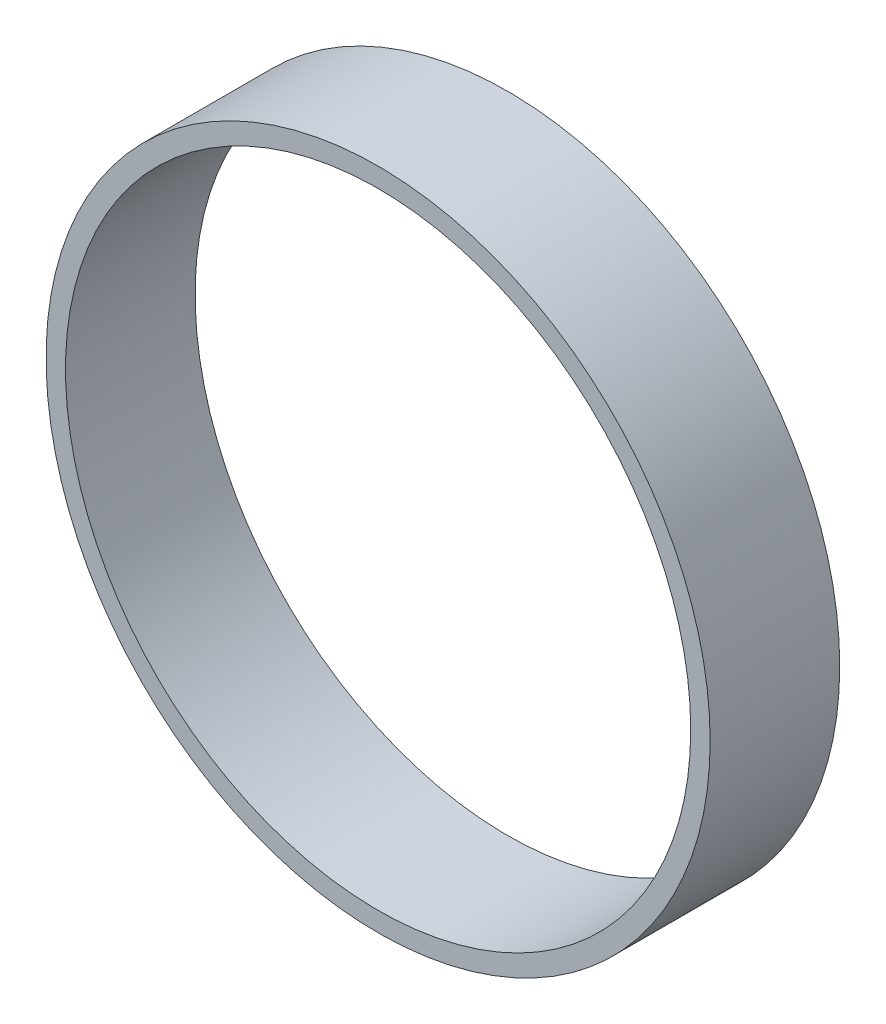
ISO-10303-21;
HEADER;
FILE_DESCRIPTION(('STEP AP214'),'2;1');
FILE_NAME('part.step','',(''),(''),'','','');
FILE_SCHEMA(('AUTOMOTIVE_DESIGN { 1 0 10303 214 1 1 1 1 }'));
ENDSEC;
DATA;
#1=APPLICATION_CONTEXT('core data for automotive mechanical design processes');
#2=APPLICATION_PROTOCOL_DEFINITION('international standard','automotive_design',2000,#1);
#3=PRODUCT_CONTEXT('',#1,'mechanical');
#4=PRODUCT('Part','Part','',(#3));
#5=PRODUCT_RELATED_PRODUCT_CATEGORY('part','',(#4));
#6=PRODUCT_DEFINITION_FORMATION('','',#4);
#7=PRODUCT_DEFINITION_CONTEXT('part definition',#1,'design');
#8=PRODUCT_DEFINITION('design','',#6,#7);
#9=PRODUCT_DEFINITION_SHAPE('','',#8);
#10=(LENGTH_UNIT() NAMED_UNIT(*) SI_UNIT(.MILLI.,.METRE.));
#11=(NAMED_UNIT(*) PLANE_ANGLE_UNIT() SI_UNIT($,.RADIAN.));
#12=(NAMED_UNIT(*) SI_UNIT($,.STERADIAN.) SOLID_ANGLE_UNIT());
#13=UNCERTAINTY_MEASURE_WITH_UNIT(LENGTH_MEASURE(1.E-05),#10,'distance_accuracy_value','');
#14=(GEOMETRIC_REPRESENTATION_CONTEXT(3) GLOBAL_UNCERTAINTY_ASSIGNED_CONTEXT((#13)) GLOBAL_UNIT_ASSIGNED_CONTEXT((#10,
#11,#12)) REPRESENTATION_CONTEXT('',''));
#15=CARTESIAN_POINT('',(0.,0.,0.));
#16=DIRECTION('',(0.,0.,1.));
#17=DIRECTION('',(1.,0.,0.));
#18=AXIS2_PLACEMENT_3D('',#15,#16,#17);
#19=CARTESIAN_POINT('',(0.,0.,-10.16));
#20=DIRECTION('',(0.,0.,1.));
#21=DIRECTION('',(1.,0.,0.));
#22=AXIS2_PLACEMENT_3D('',#19,#20,#21);
#23=CYLINDRICAL_SURFACE('',#22,26.035);
#24=CARTESIAN_POINT('',(0.,0.,-10.16));
#25=DIRECTION('',(0.,0.,1.));
#26=DIRECTION('',(1.,0.,0.));
#27=AXIS2_PLACEMENT_3D('',#24,#25,#26);
#28=CIRCLE('',#27,26.035);
#29=CARTESIAN_POINT('',(26.035,0.,-10.16));
#30=VERTEX_POINT('',#29);
#31=EDGE_CURVE('E10',#30,#30,#28,.T.);
#32=ORIENTED_EDGE('',*,*,#31,.T.);
#33=EDGE_LOOP('',(#32));
#34=FACE_BOUND('',#33,.T.);
#35=CARTESIAN_POINT('',(0.,0.,0.));
#36=DIRECTION('',(0.,0.,1.));
#37=DIRECTION('',(1.,0.,0.));
#38=AXIS2_PLACEMENT_3D('',#35,#36,#37);
#39=CIRCLE('',#38,26.035);
#40=CARTESIAN_POINT('',(26.035,0.,0.));
#41=VERTEX_POINT('',#40);
#42=EDGE_CURVE('E34',#41,#41,#39,.T.);
#43=ORIENTED_EDGE('',*,*,#42,.F.);
#44=EDGE_LOOP('',(#43));
#45=FACE_BOUND('',#44,.T.);
#46=ADVANCED_FACE('F31',(#34,#45),#23,.T.);
#47=CARTESIAN_POINT('',(0.,0.,-10.16));
#48=DIRECTION('',(0.,0.,1.));
#49=DIRECTION('',(1.,0.,0.));
#50=AXIS2_PLACEMENT_3D('',#47,#48,#49);
#51=PLANE('',#50);
#52=CARTESIAN_POINT('',(0.,0.,-10.16));
#53=DIRECTION('',(0.,0.,1.));
#54=DIRECTION('',(1.,0.,0.));
#55=AXIS2_PLACEMENT_3D('',#52,#53,#54);
#56=CIRCLE('',#55,24.511);
#57=CARTESIAN_POINT('',(24.511,0.,-10.16));
#58=VERTEX_POINT('',#57);
#59=EDGE_CURVE('E41',#58,#58,#56,.T.);
#60=ORIENTED_EDGE('',*,*,#59,.T.);
#61=EDGE_LOOP('',(#60));
#62=FACE_BOUND('',#61,.T.);
#63=ORIENTED_EDGE('',*,*,#31,.F.);
#64=EDGE_LOOP('',(#63));
#65=FACE_BOUND('',#64,.T.);
#66=ADVANCED_FACE('F49',(#62,#65),#51,.F.);
#67=CARTESIAN_POINT('',(0.,0.,0.));
#68=DIRECTION('',(0.,0.,1.));
#69=DIRECTION('',(1.,0.,0.));
#70=AXIS2_PLACEMENT_3D('',#67,#68,#69);
#71=PLANE('',#70);
#72=CARTESIAN_POINT('',(0.,0.,0.));
#73=DIRECTION('',(0.,0.,1.));
#74=DIRECTION('',(1.,0.,0.));
#75=AXIS2_PLACEMENT_3D('',#72,#73,#74);
#76=CIRCLE('',#75,24.511);
#77=CARTESIAN_POINT('',(24.511,0.,0.));
#78=VERTEX_POINT('',#77);
#79=EDGE_CURVE('E43',#78,#78,#76,.T.);
#80=ORIENTED_EDGE('',*,*,#79,.F.);
#81=EDGE_LOOP('',(#80));
#82=FACE_BOUND('',#81,.T.);
#83=ORIENTED_EDGE('',*,*,#42,.T.);
#84=EDGE_LOOP('',(#83));
#85=FACE_BOUND('',#84,.T.);
#86=ADVANCED_FACE('F55',(#82,#85),#71,.T.);
#87=CARTESIAN_POINT('',(0.,0.,-10.16));
#88=DIRECTION('',(0.,0.,1.));
#89=DIRECTION('',(1.,0.,0.));
#90=AXIS2_PLACEMENT_3D('',#87,#88,#89);
#91=CYLINDRICAL_SURFACE('',#90,24.511);
#92=ORIENTED_EDGE('',*,*,#59,.F.);
#93=EDGE_LOOP('',(#92));
#94=FACE_BOUND('',#93,.T.);
#95=ORIENTED_EDGE('',*,*,#79,.T.);
#96=EDGE_LOOP('',(#95));
#97=FACE_BOUND('',#96,.T.);
#98=ADVANCED_FACE('F52',(#94,#97),#91,.F.);
#99=CLOSED_SHELL('',(#46,#66,#86,#98));
#100=MANIFOLD_SOLID_BREP('B2',#99);
#101=ADVANCED_BREP_SHAPE_REPRESENTATION('',(#18,#100),#14);
#102=SHAPE_DEFINITION_REPRESENTATION(#9,#101);
ENDSEC;
END-ISO-10303-21;
